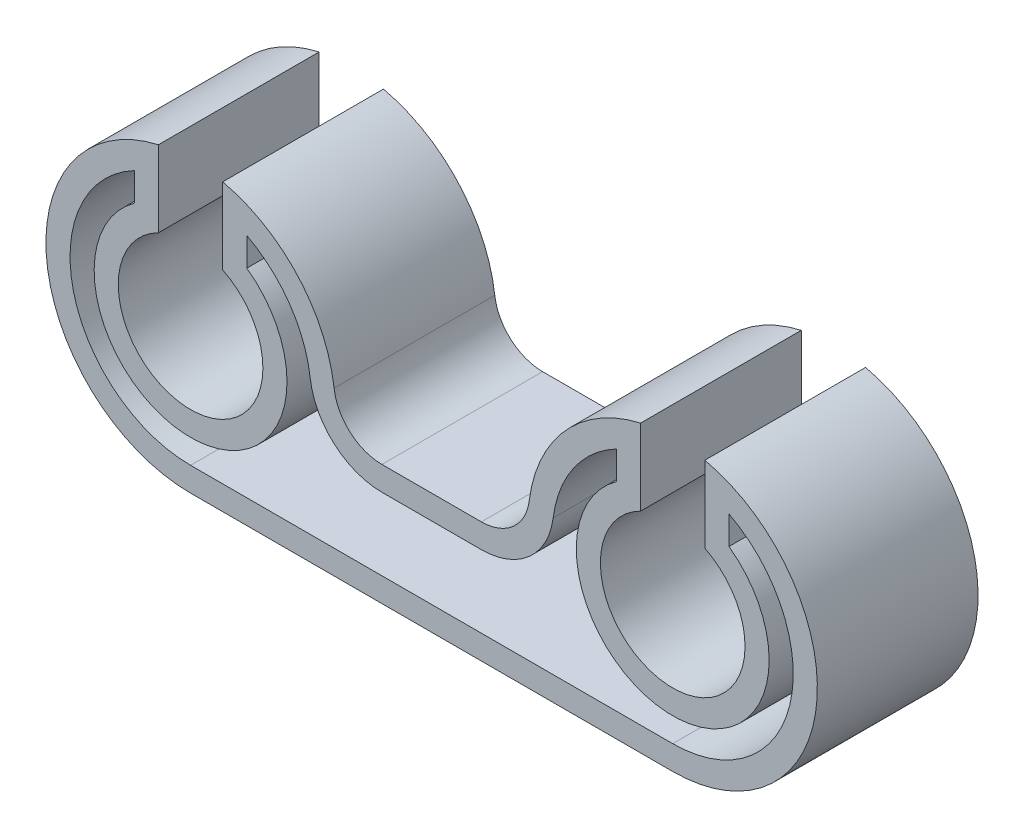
from build123d import *

# Parameters (mm, degrees)
EXTRUDE_THIN3_DEPTH = 10


with BuildPart() as part:
    # Sketch1 → Extrude-Thin3 (new, symmetric)
    with BuildSketch(Plane.XY):
        with BuildLine():
            ThreePointArc((12.14117865, 2.25), (10.156865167, -1.5), (6.1882382, -3))
            Line((6.1882382, -3), (-6.1882382, -3))
            ThreePointArc((-6.1882382, -3), (-10.156865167, -1.5), (-12.14117865, 2.25))
            ThreePointArc((-12.14117865, 2.25), (-16.659311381, 12.084122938), (-26, 17.549928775))
            Line((-26, 17.549928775), (-26, 8.062257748))
            ThreePointArc((-26, 8.062257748), (-30, -9), (-34, 8.062257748))
            Line((-34, 8.062257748), (-34, 17.549928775))
            ThreePointArc((-34, 17.549928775), (-47.887128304, -2.012620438), (-30, -18))
            Line((-30, -18), (30, -18))
            ThreePointArc((30, -18), (47.887128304, -2.012620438), (34, 17.549928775))
            Line((34, 17.549928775), (34, 8.062257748))
            ThreePointArc((34, 8.062257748), (30, -9), (26, 8.062257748))
            Line((26, 8.062257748), (26, 17.549928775))
            ThreePointArc((26, 17.549928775), (16.659311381, 12.084122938), (12.14117865, 2.25))
        make_face()
        with BuildLine():
            ThreePointArc((15.117648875, 1.875), (12.14117865, -3.75), (6.1882382, -6))
            Line((6.1882382, -6), (-6.1882382, -6))
            ThreePointArc((-6.1882382, -6), (-12.14117865, -3.75), (-15.117648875, 1.875))
            ThreePointArc((-15.117648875, 1.875), (-17.665054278, 8.535169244), (-23, 13.266499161))
            Line((-23, 13.266499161), (-23, 9.746794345))
            ThreePointArc((-23, 9.746794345), (-30, -12), (-37, 9.746794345))
            Line((-37, 9.746794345), (-37, 13.266499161))
            ThreePointArc((-37, 13.266499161), (-44.560176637, -3.605725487), (-30, -15))
            Line((-30, -15), (30, -15))
            ThreePointArc((30, -15), (44.560176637, -3.605725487), (37, 13.266499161))
            Line((37, 13.266499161), (37, 9.746794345))
            ThreePointArc((37, 9.746794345), (30, -12), (23, 9.746794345))
            Line((23, 9.746794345), (23, 13.266499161))
            ThreePointArc((23, 13.266499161), (17.665054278, 8.535169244), (15.117648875, 1.875))
        make_face(mode=Mode.SUBTRACT)
    extrude(amount=EXTRUDE_THIN3_DEPTH, both=True)


solid = part.part
